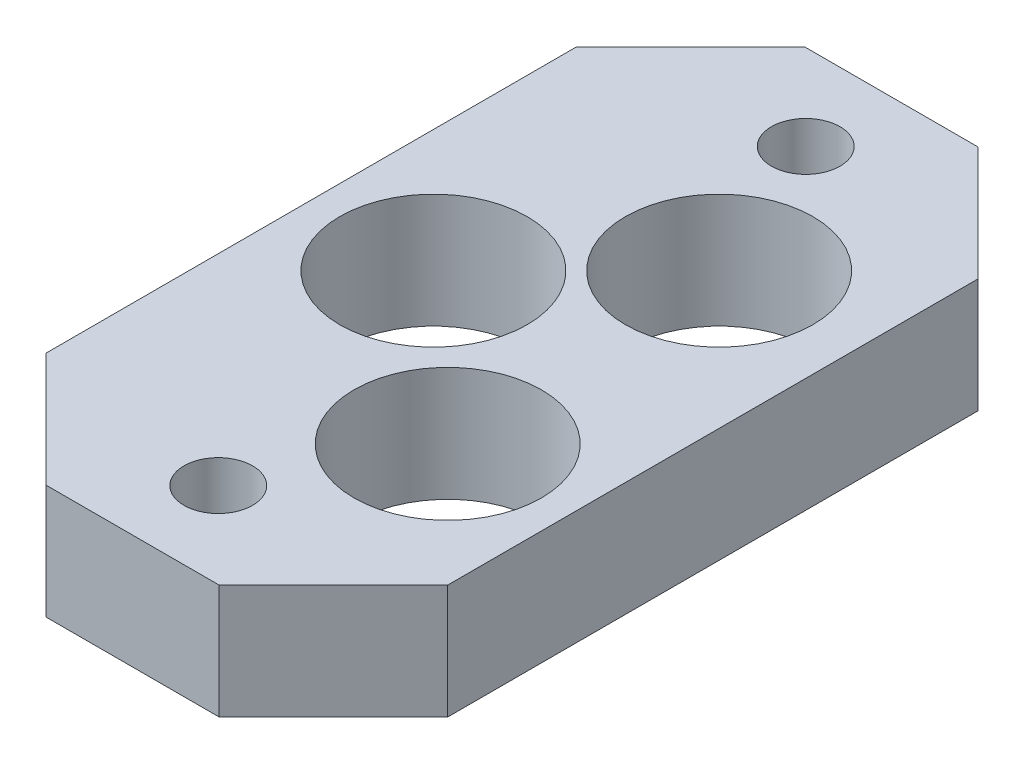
from build123d import *

# Parameters (mm, degrees)
SKETCH6_R           = 1.2
SKETCH6_R_2         = 3.28
BOSS_EXTRUDE4_DEPTH = 4


with BuildPart() as part:
    # Sketch6 → Boss-Extrude4 (new body)
    with BuildSketch(Plane(origin=(0, 0, 0), x_dir=(1, 0, 0), z_dir=(0, 1, 0))):
        Polygon((-37.72, 13.28), (-43.78, 13.28), (-47.78, 9.28), (-47.78, -9.28), (-43.78, -13.28), (-37.72, -13.28), (-33.72, -9.28), (-33.72, 9.28), align=None)
        with Locations(Location((-40.75, 10.28, 0), (0, 0, 270))):
            Circle(SKETCH6_R, mode=Mode.SUBTRACT)
        with Locations(Location((-40.75, -10.28, 0), (0, 0, 270))):
            Circle(SKETCH6_R, mode=Mode.SUBTRACT)
        with Locations(Location((-38.5, 5, 0), (0, 0, 270))):
            Circle(SKETCH6_R_2, mode=Mode.SUBTRACT)
        with Locations(Location((-43.5, 0, 0), (0, 0, 270))):
            Circle(SKETCH6_R_2, mode=Mode.SUBTRACT)
        with Locations(Location((-38, -5, 0), (0, 0, 270))):
            Circle(SKETCH6_R_2, mode=Mode.SUBTRACT)
    extrude(amount=BOSS_EXTRUDE4_DEPTH)


solid = part.part
